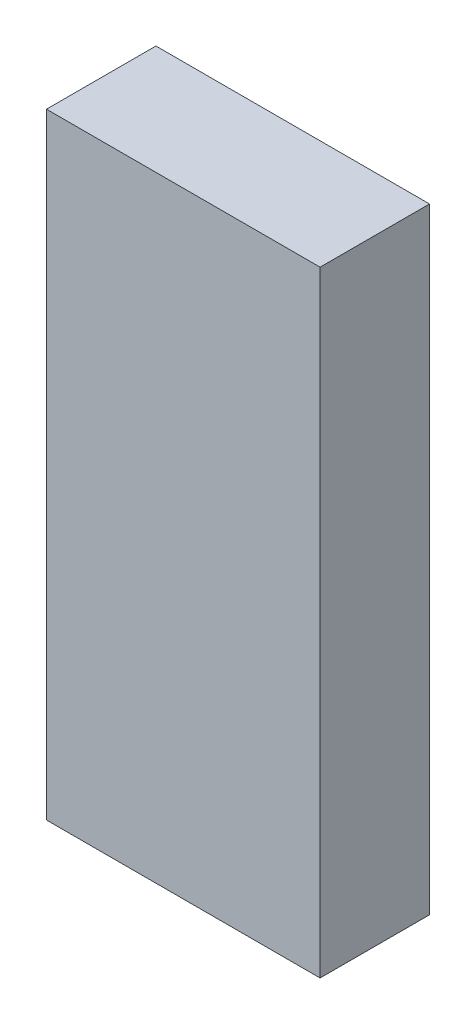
from build123d import *

# Parameters (mm, degrees)
ESQUISSE1_W      = 20
ESQUISSE1_H      = 45
EXTRUSION1_DEPTH = 8


with BuildPart() as part:
    # Esquisse1 → Extrusion1 (new body)
    with BuildSketch(Plane.XY):
        with Locations((10, 22.5)):
            Rectangle(ESQUISSE1_W, ESQUISSE1_H)
    extrude(amount=EXTRUSION1_DEPTH)


solid = part.part
